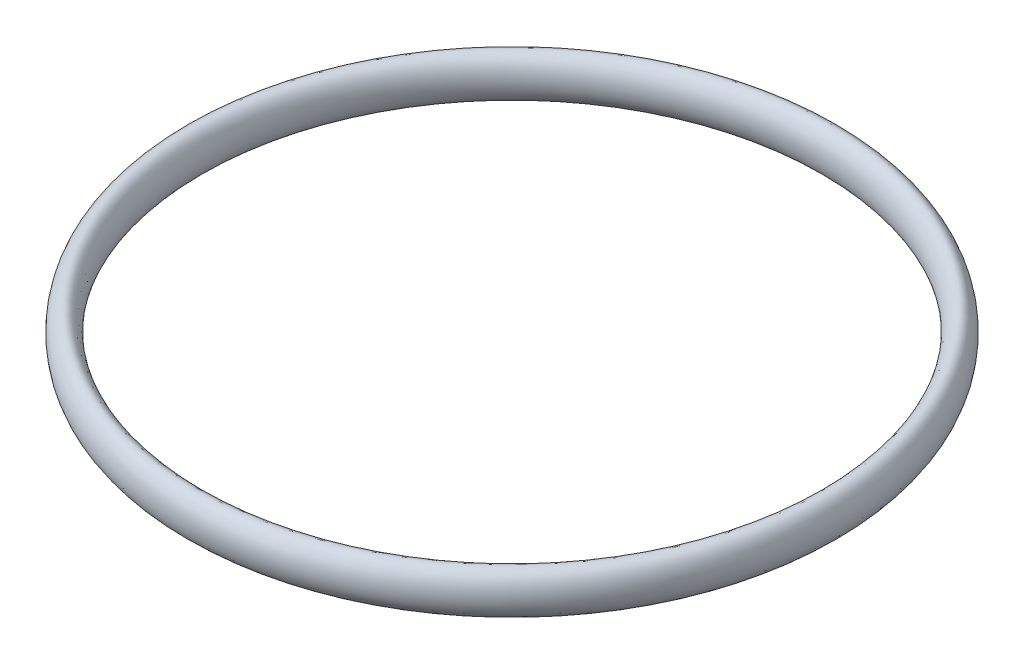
ISO-10303-21;
HEADER;
FILE_DESCRIPTION(('STEP AP214'),'2;1');
FILE_NAME('part.step','',(''),(''),'','','');
FILE_SCHEMA(('AUTOMOTIVE_DESIGN { 1 0 10303 214 1 1 1 1 }'));
ENDSEC;
DATA;
#1=APPLICATION_CONTEXT('core data for automotive mechanical design processes');
#2=APPLICATION_PROTOCOL_DEFINITION('international standard','automotive_design',2000,#1);
#3=PRODUCT_CONTEXT('',#1,'mechanical');
#4=PRODUCT('Part','Part','',(#3));
#5=PRODUCT_RELATED_PRODUCT_CATEGORY('part','',(#4));
#6=PRODUCT_DEFINITION_FORMATION('','',#4);
#7=PRODUCT_DEFINITION_CONTEXT('part definition',#1,'design');
#8=PRODUCT_DEFINITION('design','',#6,#7);
#9=PRODUCT_DEFINITION_SHAPE('','',#8);
#10=(LENGTH_UNIT() NAMED_UNIT(*) SI_UNIT(.MILLI.,.METRE.));
#11=(NAMED_UNIT(*) PLANE_ANGLE_UNIT() SI_UNIT($,.RADIAN.));
#12=(NAMED_UNIT(*) SI_UNIT($,.STERADIAN.) SOLID_ANGLE_UNIT());
#13=UNCERTAINTY_MEASURE_WITH_UNIT(LENGTH_MEASURE(1.E-05),#10,'distance_accuracy_value','');
#14=(GEOMETRIC_REPRESENTATION_CONTEXT(3) GLOBAL_UNCERTAINTY_ASSIGNED_CONTEXT((#13)) GLOBAL_UNIT_ASSIGNED_CONTEXT((#10,
#11,#12)) REPRESENTATION_CONTEXT('',''));
#15=CARTESIAN_POINT('',(0.,0.,0.));
#16=DIRECTION('',(0.,0.,1.));
#17=DIRECTION('',(1.,0.,0.));
#18=AXIS2_PLACEMENT_3D('',#15,#16,#17);
#19=CARTESIAN_POINT('',(-52.825,-3.55,0.));
#20=DIRECTION('',(0.,0.,1.));
#21=DIRECTION('',(0.,1.,0.));
#22=AXIS2_PLACEMENT_3D('',#19,#20,#21);
#23=ELLIPSE('',#22,3.55,2.175);
#24=CARTESIAN_POINT('',(0.,51.6737551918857,0.));
#25=DIRECTION('',(0.,1.,0.));
#26=AXIS1_PLACEMENT('',#24,#25);
#27=SURFACE_OF_REVOLUTION('',#23,#26);
#28=ADVANCED_FACE('F439',(),#27,.F.);
#29=CLOSED_SHELL('',(#28));
#30=MANIFOLD_SOLID_BREP('B2',#29);
#31=ADVANCED_BREP_SHAPE_REPRESENTATION('',(#18,#30),#14);
#32=SHAPE_DEFINITION_REPRESENTATION(#9,#31);
ENDSEC;
END-ISO-10303-21;
